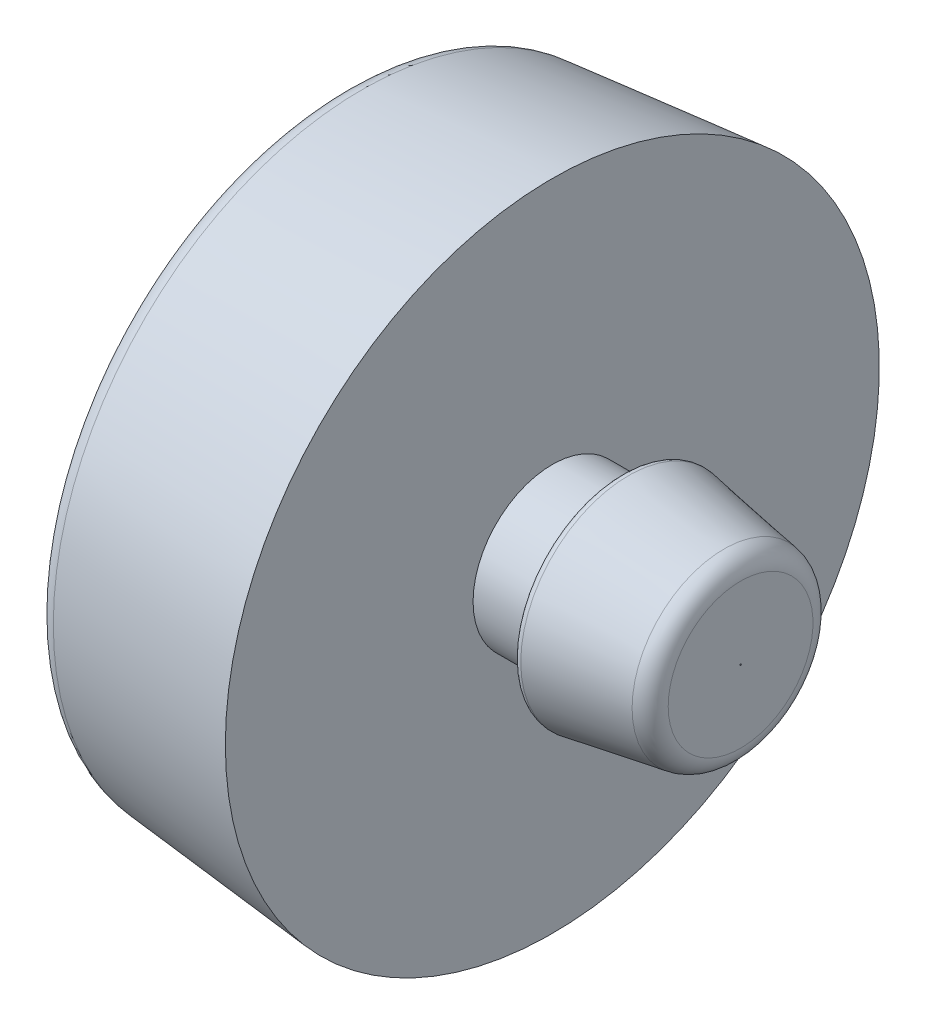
ISO-10303-21;
HEADER;
FILE_DESCRIPTION(('STEP AP214'),'2;1');
FILE_NAME('part.step','',(''),(''),'','','');
FILE_SCHEMA(('AUTOMOTIVE_DESIGN { 1 0 10303 214 1 1 1 1 }'));
ENDSEC;
DATA;
#1=APPLICATION_CONTEXT('core data for automotive mechanical design processes');
#2=APPLICATION_PROTOCOL_DEFINITION('international standard','automotive_design',2000,#1);
#3=PRODUCT_CONTEXT('',#1,'mechanical');
#4=PRODUCT('Part','Part','',(#3));
#5=PRODUCT_RELATED_PRODUCT_CATEGORY('part','',(#4));
#6=PRODUCT_DEFINITION_FORMATION('','',#4);
#7=PRODUCT_DEFINITION_CONTEXT('part definition',#1,'design');
#8=PRODUCT_DEFINITION('design','',#6,#7);
#9=PRODUCT_DEFINITION_SHAPE('','',#8);
#10=(LENGTH_UNIT() NAMED_UNIT(*) SI_UNIT(.MILLI.,.METRE.));
#11=(NAMED_UNIT(*) PLANE_ANGLE_UNIT() SI_UNIT($,.RADIAN.));
#12=(NAMED_UNIT(*) SI_UNIT($,.STERADIAN.) SOLID_ANGLE_UNIT());
#13=UNCERTAINTY_MEASURE_WITH_UNIT(LENGTH_MEASURE(1.E-05),#10,'distance_accuracy_value','');
#14=(GEOMETRIC_REPRESENTATION_CONTEXT(3) GLOBAL_UNCERTAINTY_ASSIGNED_CONTEXT((#13)) GLOBAL_UNIT_ASSIGNED_CONTEXT((#10,
#11,#12)) REPRESENTATION_CONTEXT('',''));
#15=CARTESIAN_POINT('',(0.,0.,0.));
#16=DIRECTION('',(0.,0.,1.));
#17=DIRECTION('',(1.,0.,0.));
#18=AXIS2_PLACEMENT_3D('',#15,#16,#17);
#19=CARTESIAN_POINT('',(-8.55846111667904,0.,0.));
#20=DIRECTION('',(-1.,0.,0.));
#21=DIRECTION('',(0.,0.,1.));
#22=AXIS2_PLACEMENT_3D('',#19,#20,#21);
#23=CYLINDRICAL_SURFACE('',#22,0.0348731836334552);
#24=CARTESIAN_POINT('',(20.,0.,0.));
#25=DIRECTION('',(-1.,0.,0.));
#26=DIRECTION('',(0.,0.,1.));
#27=AXIS2_PLACEMENT_3D('',#24,#25,#26);
#28=CIRCLE('',#27,0.0348731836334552);
#29=CARTESIAN_POINT('',(20.,0.,0.0348731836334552));
#30=VERTEX_POINT('',#29);
#31=EDGE_CURVE('E10',#30,#30,#28,.T.);
#32=ORIENTED_EDGE('',*,*,#31,.F.);
#33=EDGE_LOOP('',(#32));
#34=FACE_BOUND('',#33,.T.);
#35=CARTESIAN_POINT('',(0.,0.,0.));
#36=DIRECTION('',(-1.,0.,0.));
#37=DIRECTION('',(0.,0.,1.));
#38=AXIS2_PLACEMENT_3D('',#35,#36,#37);
#39=CIRCLE('',#38,0.0348731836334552);
#40=CARTESIAN_POINT('',(0.,0.,0.0348731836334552));
#41=VERTEX_POINT('',#40);
#42=EDGE_CURVE('E67',#41,#41,#39,.T.);
#43=ORIENTED_EDGE('',*,*,#42,.T.);
#44=EDGE_LOOP('',(#43));
#45=FACE_BOUND('',#44,.T.);
#46=ADVANCED_FACE('F30',(#34,#45),#23,.F.);
#47=CARTESIAN_POINT('',(20.,0.0348731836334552,0.));
#48=DIRECTION('',(-1.,0.,0.));
#49=DIRECTION('',(0.,0.,1.));
#50=AXIS2_PLACEMENT_3D('',#47,#48,#49);
#51=PLANE('',#50);
#52=CARTESIAN_POINT('',(20.,0.,0.));
#53=DIRECTION('',(-1.,0.,0.));
#54=DIRECTION('',(0.,0.,1.));
#55=AXIS2_PLACEMENT_3D('',#52,#53,#54);
#56=CIRCLE('',#55,3.65287291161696);
#57=CARTESIAN_POINT('',(20.,0.,3.65287291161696));
#58=VERTEX_POINT('',#57);
#59=EDGE_CURVE('E36',#58,#58,#56,.T.);
#60=ORIENTED_EDGE('',*,*,#59,.F.);
#61=EDGE_LOOP('',(#60));
#62=FACE_BOUND('',#61,.T.);
#63=ORIENTED_EDGE('',*,*,#31,.T.);
#64=EDGE_LOOP('',(#63));
#65=FACE_BOUND('',#64,.T.);
#66=ADVANCED_FACE('F122',(#62,#65),#51,.F.);
#67=CARTESIAN_POINT('',(19.,0.,0.));
#68=DIRECTION('',(-1.,0.,0.));
#69=DIRECTION('',(0.,0.,1.));
#70=AXIS2_PLACEMENT_3D('',#67,#68,#69);
#71=TOROIDAL_SURFACE('',#70,3.65287291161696,1.);
#72=CARTESIAN_POINT('',(19.1643989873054,0.,0.));
#73=DIRECTION('',(-1.,0.,0.));
#74=DIRECTION('',(0.,0.,1.));
#75=AXIS2_PLACEMENT_3D('',#72,#73,#74);
#76=CIRCLE('',#75,4.63926683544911);
#77=CARTESIAN_POINT('',(19.1643989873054,0.,4.63926683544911));
#78=VERTEX_POINT('',#77);
#79=EDGE_CURVE('E40',#78,#78,#76,.T.);
#80=ORIENTED_EDGE('',*,*,#79,.F.);
#81=EDGE_LOOP('',(#80));
#82=FACE_BOUND('',#81,.T.);
#83=ORIENTED_EDGE('',*,*,#59,.T.);
#84=EDGE_LOOP('',(#83));
#85=FACE_BOUND('',#84,.T.);
#86=ADVANCED_FACE('F117',(#82,#85),#71,.T.);
#87=CARTESIAN_POINT('',(19.1643989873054,0.,0.));
#88=DIRECTION('',(-1.,0.,0.));
#89=DIRECTION('',(0.,0.,1.));
#90=AXIS2_PLACEMENT_3D('',#87,#88,#89);
#91=CONICAL_SURFACE('',#90,4.63926683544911,0.165148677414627);
#92=CARTESIAN_POINT('',(14.3493196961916,0.,0.));
#93=DIRECTION('',(-1.,0.,0.));
#94=DIRECTION('',(0.,0.,1.));
#95=AXIS2_PLACEMENT_3D('',#92,#93,#94);
#96=CIRCLE('',#95,5.44178005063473);
#97=CARTESIAN_POINT('',(14.3493196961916,0.,5.44178005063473));
#98=VERTEX_POINT('',#97);
#99=EDGE_CURVE('E44',#98,#98,#96,.T.);
#100=ORIENTED_EDGE('',*,*,#99,.F.);
#101=EDGE_LOOP('',(#100));
#102=FACE_BOUND('',#101,.T.);
#103=ORIENTED_EDGE('',*,*,#79,.T.);
#104=EDGE_LOOP('',(#103));
#105=FACE_BOUND('',#104,.T.);
#106=ADVANCED_FACE('F111',(#102,#105),#91,.T.);
#107=CARTESIAN_POINT('',(14.3,0.,0.));
#108=DIRECTION('',(-1.,0.,0.));
#109=DIRECTION('',(0.,0.,1.));
#110=AXIS2_PLACEMENT_3D('',#107,#108,#109);
#111=TOROIDAL_SURFACE('',#110,5.14586187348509,0.3);
#112=CARTESIAN_POINT('',(14.,0.,0.));
#113=DIRECTION('',(-1.,0.,0.));
#114=DIRECTION('',(0.,0.,1.));
#115=AXIS2_PLACEMENT_3D('',#112,#113,#114);
#116=CIRCLE('',#115,5.14586187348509);
#117=CARTESIAN_POINT('',(14.,0.,5.14586187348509));
#118=VERTEX_POINT('',#117);
#119=EDGE_CURVE('E49',#118,#118,#116,.T.);
#120=ORIENTED_EDGE('',*,*,#119,.F.);
#121=EDGE_LOOP('',(#120));
#122=FACE_BOUND('',#121,.T.);
#123=ORIENTED_EDGE('',*,*,#99,.T.);
#124=EDGE_LOOP('',(#123));
#125=FACE_BOUND('',#124,.T.);
#126=ADVANCED_FACE('F105',(#122,#125),#111,.T.);
#127=CARTESIAN_POINT('',(14.,4.,0.));
#128=DIRECTION('',(1.,0.,0.));
#129=DIRECTION('',(0.,0.,-1.));
#130=AXIS2_PLACEMENT_3D('',#127,#128,#129);
#131=PLANE('',#130);
#132=CARTESIAN_POINT('',(14.,0.,0.));
#133=DIRECTION('',(-1.,0.,0.));
#134=DIRECTION('',(0.,0.,1.));
#135=AXIS2_PLACEMENT_3D('',#132,#133,#134);
#136=CIRCLE('',#135,4.);
#137=CARTESIAN_POINT('',(14.,0.,4.));
#138=VERTEX_POINT('',#137);
#139=EDGE_CURVE('E52',#138,#138,#136,.T.);
#140=ORIENTED_EDGE('',*,*,#139,.F.);
#141=EDGE_LOOP('',(#140));
#142=FACE_BOUND('',#141,.T.);
#143=ORIENTED_EDGE('',*,*,#119,.T.);
#144=EDGE_LOOP('',(#143));
#145=FACE_BOUND('',#144,.T.);
#146=ADVANCED_FACE('F99',(#142,#145),#131,.F.);
#147=CARTESIAN_POINT('',(-8.55846111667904,0.,0.));
#148=DIRECTION('',(-1.,0.,0.));
#149=DIRECTION('',(0.,0.,1.));
#150=AXIS2_PLACEMENT_3D('',#147,#148,#149);
#151=CYLINDRICAL_SURFACE('',#150,4.);
#152=CARTESIAN_POINT('',(10.5,0.,0.));
#153=DIRECTION('',(-1.,0.,0.));
#154=DIRECTION('',(0.,0.,1.));
#155=AXIS2_PLACEMENT_3D('',#152,#153,#154);
#156=CIRCLE('',#155,4.);
#157=CARTESIAN_POINT('',(10.5,0.,4.));
#158=VERTEX_POINT('',#157);
#159=EDGE_CURVE('E55',#158,#158,#156,.T.);
#160=ORIENTED_EDGE('',*,*,#159,.F.);
#161=EDGE_LOOP('',(#160));
#162=FACE_BOUND('',#161,.T.);
#163=ORIENTED_EDGE('',*,*,#139,.T.);
#164=EDGE_LOOP('',(#163));
#165=FACE_BOUND('',#164,.T.);
#166=ADVANCED_FACE('F93',(#162,#165),#151,.T.);
#167=CARTESIAN_POINT('',(10.5,16.5,0.));
#168=DIRECTION('',(-1.,0.,0.));
#169=DIRECTION('',(0.,0.,1.));
#170=AXIS2_PLACEMENT_3D('',#167,#168,#169);
#171=PLANE('',#170);
#172=CARTESIAN_POINT('',(10.5,0.,0.));
#173=DIRECTION('',(-1.,0.,0.));
#174=DIRECTION('',(0.,0.,1.));
#175=AXIS2_PLACEMENT_3D('',#172,#173,#174);
#176=CIRCLE('',#175,16.5);
#177=CARTESIAN_POINT('',(10.5,0.,16.5));
#178=VERTEX_POINT('',#177);
#179=EDGE_CURVE('E58',#178,#178,#176,.T.);
#180=ORIENTED_EDGE('',*,*,#179,.F.);
#181=EDGE_LOOP('',(#180));
#182=FACE_BOUND('',#181,.T.);
#183=ORIENTED_EDGE('',*,*,#159,.T.);
#184=EDGE_LOOP('',(#183));
#185=FACE_BOUND('',#184,.T.);
#186=ADVANCED_FACE('F87',(#182,#185),#171,.F.);
#187=CARTESIAN_POINT('',(10.5,0.,0.));
#188=DIRECTION('',(1.,0.,0.));
#189=DIRECTION('',(0.,0.,-1.));
#190=AXIS2_PLACEMENT_3D('',#187,#188,#189);
#191=CONICAL_SURFACE('',#190,16.5,0.0949517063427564);
#192=CARTESIAN_POINT('',(0.905190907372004,0.,0.));
#193=DIRECTION('',(-1.,0.,0.));
#194=DIRECTION('',(0.,0.,1.));
#195=AXIS2_PLACEMENT_3D('',#192,#193,#194);
#196=CIRCLE('',#195,15.586208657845);
#197=CARTESIAN_POINT('',(0.905190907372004,0.,15.586208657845));
#198=VERTEX_POINT('',#197);
#199=EDGE_CURVE('E61',#198,#198,#196,.T.);
#200=ORIENTED_EDGE('',*,*,#199,.F.);
#201=EDGE_LOOP('',(#200));
#202=FACE_BOUND('',#201,.T.);
#203=ORIENTED_EDGE('',*,*,#179,.T.);
#204=EDGE_LOOP('',(#203));
#205=FACE_BOUND('',#204,.T.);
#206=ADVANCED_FACE('F81',(#202,#205),#191,.T.);
#207=CARTESIAN_POINT('',(0.999999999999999,0.,0.));
#208=DIRECTION('',(-1.,0.,0.));
#209=DIRECTION('',(0.,0.,1.));
#210=AXIS2_PLACEMENT_3D('',#207,#208,#209);
#211=TOROIDAL_SURFACE('',#210,14.590713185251,1.);
#212=CARTESIAN_POINT('',(0.,0.,0.));
#213=DIRECTION('',(-1.,0.,0.));
#214=DIRECTION('',(0.,0.,1.));
#215=AXIS2_PLACEMENT_3D('',#212,#213,#214);
#216=CIRCLE('',#215,14.590713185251);
#217=CARTESIAN_POINT('',(0.,0.,14.590713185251));
#218=VERTEX_POINT('',#217);
#219=EDGE_CURVE('E64',#218,#218,#216,.T.);
#220=ORIENTED_EDGE('',*,*,#219,.F.);
#221=EDGE_LOOP('',(#220));
#222=FACE_BOUND('',#221,.T.);
#223=ORIENTED_EDGE('',*,*,#199,.T.);
#224=EDGE_LOOP('',(#223));
#225=FACE_BOUND('',#224,.T.);
#226=ADVANCED_FACE('F75',(#222,#225),#211,.T.);
#227=CARTESIAN_POINT('',(0.,0.0348731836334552,0.));
#228=DIRECTION('',(1.,0.,0.));
#229=DIRECTION('',(0.,0.,-1.));
#230=AXIS2_PLACEMENT_3D('',#227,#228,#229);
#231=PLANE('',#230);
#232=ORIENTED_EDGE('',*,*,#42,.F.);
#233=EDGE_LOOP('',(#232));
#234=FACE_BOUND('',#233,.T.);
#235=ORIENTED_EDGE('',*,*,#219,.T.);
#236=EDGE_LOOP('',(#235));
#237=FACE_BOUND('',#236,.T.);
#238=ADVANCED_FACE('F72',(#234,#237),#231,.F.);
#239=CLOSED_SHELL('',(#46,#66,#86,#106,#126,#146,#166,#186,#206,#226,#238));
#240=MANIFOLD_SOLID_BREP('B2',#239);
#241=ADVANCED_BREP_SHAPE_REPRESENTATION('',(#18,#240),#14);
#242=SHAPE_DEFINITION_REPRESENTATION(#9,#241);
ENDSEC;
END-ISO-10303-21;
